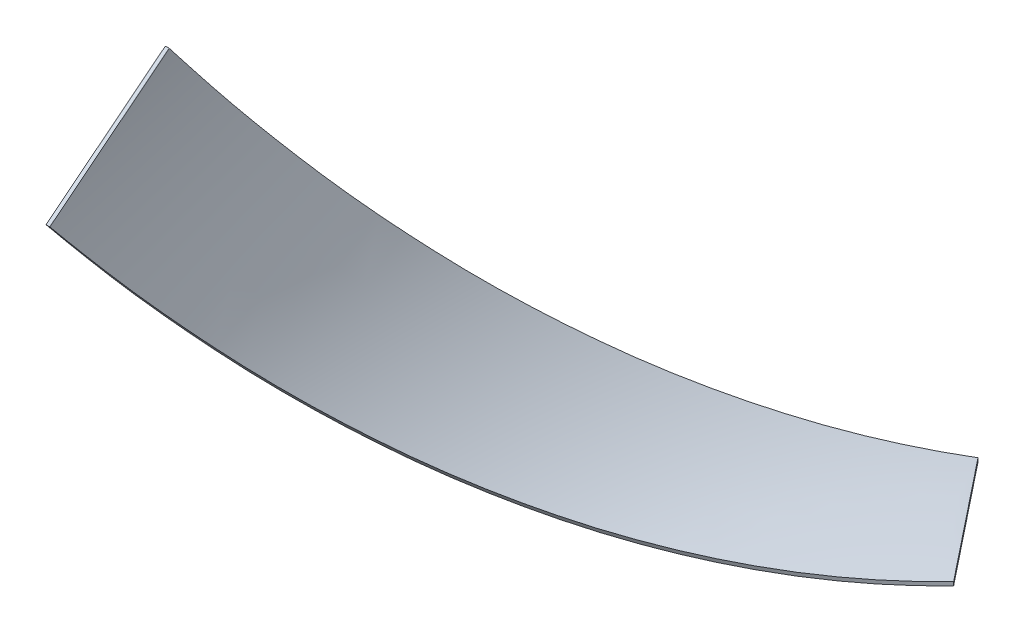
ISO-10303-21;
HEADER;
FILE_DESCRIPTION(('STEP AP214'),'2;1');
FILE_NAME('part.step','',(''),(''),'','','');
FILE_SCHEMA(('AUTOMOTIVE_DESIGN { 1 0 10303 214 1 1 1 1 }'));
ENDSEC;
DATA;
#1=APPLICATION_CONTEXT('core data for automotive mechanical design processes');
#2=APPLICATION_PROTOCOL_DEFINITION('international standard','automotive_design',2000,#1);
#3=PRODUCT_CONTEXT('',#1,'mechanical');
#4=PRODUCT('Part','Part','',(#3));
#5=PRODUCT_RELATED_PRODUCT_CATEGORY('part','',(#4));
#6=PRODUCT_DEFINITION_FORMATION('','',#4);
#7=PRODUCT_DEFINITION_CONTEXT('part definition',#1,'design');
#8=PRODUCT_DEFINITION('design','',#6,#7);
#9=PRODUCT_DEFINITION_SHAPE('','',#8);
#10=(LENGTH_UNIT() NAMED_UNIT(*) SI_UNIT(.MILLI.,.METRE.));
#11=(NAMED_UNIT(*) PLANE_ANGLE_UNIT() SI_UNIT($,.RADIAN.));
#12=(NAMED_UNIT(*) SI_UNIT($,.STERADIAN.) SOLID_ANGLE_UNIT());
#13=UNCERTAINTY_MEASURE_WITH_UNIT(LENGTH_MEASURE(1.E-05),#10,'distance_accuracy_value','');
#14=(GEOMETRIC_REPRESENTATION_CONTEXT(3) GLOBAL_UNCERTAINTY_ASSIGNED_CONTEXT((#13)) GLOBAL_UNIT_ASSIGNED_CONTEXT((#10,
#11,#12)) REPRESENTATION_CONTEXT('',''));
#15=CARTESIAN_POINT('',(0.,0.,0.));
#16=DIRECTION('',(0.,0.,1.));
#17=DIRECTION('',(1.,0.,0.));
#18=AXIS2_PLACEMENT_3D('',#15,#16,#17);
#19=CARTESIAN_POINT('',(-6.22676992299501,-49.75,-7.82478985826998));
#20=DIRECTION('',(-0.782478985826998,0.,0.622676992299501));
#21=DIRECTION('',(0.622676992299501,0.,0.782478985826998));
#22=AXIS2_PLACEMENT_3D('',#19,#20,#21);
#23=PLANE('',#22);
#24=DIRECTION('',(0.,1.,0.));
#25=VECTOR('',#24,1.);
#26=CARTESIAN_POINT('',(-6.22676992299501,-49.75,-7.82478985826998));
#27=LINE('',#26,#25);
#28=CARTESIAN_POINT('',(-6.22676992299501,-50.25,-7.82478985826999));
#29=VERTEX_POINT('',#28);
#30=CARTESIAN_POINT('',(-6.22676992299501,-49.75,-7.82478985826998));
#31=VERTEX_POINT('',#30);
#32=EDGE_CURVE('E73',#29,#31,#27,.T.);
#33=ORIENTED_EDGE('',*,*,#32,.T.);
#34=DIRECTION('',(0.622676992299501,0.,0.782478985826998));
#35=VECTOR('',#34,1.);
#36=CARTESIAN_POINT('',(-6.22676992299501,-49.75,-7.82478985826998));
#37=LINE('',#36,#35);
#38=CARTESIAN_POINT('',(6.22676992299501,-49.75,7.82478985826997));
#39=VERTEX_POINT('',#38);
#40=EDGE_CURVE('E68',#31,#39,#37,.T.);
#41=ORIENTED_EDGE('',*,*,#40,.T.);
#42=DIRECTION('',(0.,-1.,0.));
#43=VECTOR('',#42,1.);
#44=CARTESIAN_POINT('',(6.22676992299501,-49.75,7.82478985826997));
#45=LINE('',#44,#43);
#46=CARTESIAN_POINT('',(6.22676992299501,-50.25,7.82478985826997));
#47=VERTEX_POINT('',#46);
#48=EDGE_CURVE('E85',#39,#47,#45,.T.);
#49=ORIENTED_EDGE('',*,*,#48,.T.);
#50=DIRECTION('',(-0.622676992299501,0.,-0.782478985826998));
#51=VECTOR('',#50,1.);
#52=CARTESIAN_POINT('',(-6.22676992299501,-50.25,-7.82478985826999));
#53=LINE('',#52,#51);
#54=EDGE_CURVE('E78',#47,#29,#53,.T.);
#55=ORIENTED_EDGE('',*,*,#54,.T.);
#56=EDGE_LOOP('',(#33,#41,#49,#55));
#57=FACE_BOUND('',#56,.T.);
#58=ADVANCED_FACE('F33',(#57),#23,.F.);
#59=CARTESIAN_POINT('',(-49.75,6.22676992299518,54.67521014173));
#60=DIRECTION('',(0.,0.782478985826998,0.622676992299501));
#61=DIRECTION('',(0.,-0.622676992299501,0.782478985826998));
#62=AXIS2_PLACEMENT_3D('',#59,#60,#61);
#63=PLANE('',#62);
#64=DIRECTION('',(1.,0.,0.));
#65=VECTOR('',#64,1.);
#66=CARTESIAN_POINT('',(-49.75,6.22676992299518,54.67521014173));
#67=LINE('',#66,#65);
#68=CARTESIAN_POINT('',(-50.25,6.22676992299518,54.67521014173));
#69=VERTEX_POINT('',#68);
#70=CARTESIAN_POINT('',(-49.75,6.22676992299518,54.67521014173));
#71=VERTEX_POINT('',#70);
#72=EDGE_CURVE('E47',#69,#71,#67,.T.);
#73=ORIENTED_EDGE('',*,*,#72,.F.);
#74=DIRECTION('',(0.,0.622676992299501,-0.782478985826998));
#75=VECTOR('',#74,1.);
#76=CARTESIAN_POINT('',(-50.25,6.22676992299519,54.67521014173));
#77=LINE('',#76,#75);
#78=CARTESIAN_POINT('',(-50.25,-6.22676992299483,70.32478985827));
#79=VERTEX_POINT('',#78);
#80=EDGE_CURVE('E56',#79,#69,#77,.T.);
#81=ORIENTED_EDGE('',*,*,#80,.F.);
#82=DIRECTION('',(-1.,0.,0.));
#83=VECTOR('',#82,1.);
#84=CARTESIAN_POINT('',(-49.75,-6.22676992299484,70.32478985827));
#85=LINE('',#84,#83);
#86=CARTESIAN_POINT('',(-49.75,-6.22676992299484,70.32478985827));
#87=VERTEX_POINT('',#86);
#88=EDGE_CURVE('E93',#87,#79,#85,.T.);
#89=ORIENTED_EDGE('',*,*,#88,.F.);
#90=DIRECTION('',(0.,-0.622676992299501,0.782478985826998));
#91=VECTOR('',#90,1.);
#92=CARTESIAN_POINT('',(-49.75,6.22676992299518,54.67521014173));
#93=LINE('',#92,#91);
#94=EDGE_CURVE('E11',#71,#87,#93,.T.);
#95=ORIENTED_EDGE('',*,*,#94,.F.);
#96=EDGE_LOOP('',(#73,#81,#89,#95));
#97=FACE_BOUND('',#96,.T.);
#98=ADVANCED_FACE('F147',(#97),#63,.T.);
#99=CARTESIAN_POINT('',(6.22676992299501,-49.75,7.82478985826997));
#100=CARTESIAN_POINT('',(-0.926200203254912,-50.6452743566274,13.5066080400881));
#101=CARTESIAN_POINT('',(-8.04165271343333,-49.4890592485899,19.1884262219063));
#102=CARTESIAN_POINT('',(-15.1571052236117,-48.3328441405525,24.8702444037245));
#103=CARTESIAN_POINT('',(-21.6585884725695,-45.2188092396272,30.5520625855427));
#104=CARTESIAN_POINT('',(-28.1600717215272,-42.104774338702,36.2338807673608));
#105=CARTESIAN_POINT('',(-33.5208742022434,-37.2852002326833,41.915698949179));
#106=CARTESIAN_POINT('',(-38.8816766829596,-32.4656261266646,47.5975171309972));
#107=CARTESIAN_POINT('',(-42.6674980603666,-26.3309660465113,53.2793353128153));
#108=CARTESIAN_POINT('',(-46.4533194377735,-20.196305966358,58.9611534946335));
#109=CARTESIAN_POINT('',(-48.3574549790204,-13.2435535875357,64.6429716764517));
#110=CARTESIAN_POINT('',(-50.2615905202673,-6.2908012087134,70.3247898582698));
#111=CARTESIAN_POINT('',(-50.1297784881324,0.916772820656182,76.006608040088));
#112=CARTESIAN_POINT('',(6.22676992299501,-50.25,7.82478985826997));
#113=CARTESIAN_POINT('',(-0.998089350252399,-51.1452743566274,13.5066080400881));
#114=CARTESIAN_POINT('',(-8.18251899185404,-49.9688057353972,19.1884262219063));
#115=CARTESIAN_POINT('',(-15.3669486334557,-48.792337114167,24.8702444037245));
#116=CARTESIAN_POINT('',(-21.9289088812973,-45.6394360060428,30.5520625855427));
#117=CARTESIAN_POINT('',(-28.4908691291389,-42.4865348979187,36.2338807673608));
#118=CARTESIAN_POINT('',(-33.8987489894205,-37.612630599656,41.915698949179));
#119=CARTESIAN_POINT('',(-39.3066288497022,-32.7387263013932,47.5975171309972));
#120=CARTESIAN_POINT('',(-43.1223140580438,-26.5386735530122,53.2793353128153));
#121=CARTESIAN_POINT('',(-46.9379992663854,-20.3386208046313,58.9611534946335));
#122=CARTESIAN_POINT('',(-48.8523656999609,-13.3147110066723,64.6429716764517));
#123=CARTESIAN_POINT('',(-50.7667321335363,-6.2908012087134,70.3247898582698));
#124=CARTESIAN_POINT('',(-50.6246892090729,0.987930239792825,76.006608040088));
#125=(BOUNDED_SURFACE() B_SPLINE_SURFACE(1,2,((#99,#100,#101,#102,#103,#104,#105,#106,#107,#108,
#109,#110,#111),(#112,#113,#114,#115,#116,#117,#118,#119,#120,#121,#122,#123,#124)),
.UNSPECIFIED.,.F.,.F.,.F.) B_SPLINE_SURFACE_WITH_KNOTS((2,2),(3,2,2,2,2,2,3),(0.,1.),(0.,
0.166666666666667,0.333333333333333,0.5,0.666666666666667,0.833333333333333,1.),
.UNSPECIFIED.) GEOMETRIC_REPRESENTATION_ITEM() RATIONAL_B_SPLINE_SURFACE(((1.,0.989821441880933,
1.,0.989821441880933,1.,0.989821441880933,1.,0.989821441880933,1.,0.989821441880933,1.,
0.989821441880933,1.),(1.,0.989821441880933,1.,0.989821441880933,1.,0.989821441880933,1.,
0.989821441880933,1.,0.989821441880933,1.,0.989821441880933,1.))) REPRESENTATION_ITEM('') SURFACE());
#126=CARTESIAN_POINT('',(6.22676992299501,-50.25,7.82478985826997));
#127=CARTESIAN_POINT('',(-0.998089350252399,-51.1452743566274,13.5066080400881));
#128=CARTESIAN_POINT('',(-8.18251899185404,-49.9688057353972,19.1884262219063));
#129=CARTESIAN_POINT('',(-15.3669486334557,-48.792337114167,24.8702444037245));
#130=CARTESIAN_POINT('',(-21.9289088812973,-45.6394360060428,30.5520625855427));
#131=CARTESIAN_POINT('',(-28.4908691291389,-42.4865348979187,36.2338807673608));
#132=CARTESIAN_POINT('',(-33.8987489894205,-37.612630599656,41.915698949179));
#133=CARTESIAN_POINT('',(-39.3066288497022,-32.7387263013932,47.5975171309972));
#134=CARTESIAN_POINT('',(-43.1223140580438,-26.5386735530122,53.2793353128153));
#135=CARTESIAN_POINT('',(-46.9379992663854,-20.3386208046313,58.9611534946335));
#136=CARTESIAN_POINT('',(-48.8523656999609,-13.3147110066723,64.6429716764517));
#137=CARTESIAN_POINT('',(-50.7667321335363,-6.2908012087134,70.3247898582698));
#138=CARTESIAN_POINT('',(-50.6246892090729,0.987930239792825,76.006608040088));
#139=(BOUNDED_CURVE() B_SPLINE_CURVE(2,(#126,#127,#128,#129,#130,#131,#132,#133,#134,#135,#136,
#137,#138),.UNSPECIFIED.,.F.,.F.) B_SPLINE_CURVE_WITH_KNOTS((3,2,2,2,2,2,3),(0.,
0.166666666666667,0.333333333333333,0.5,0.666666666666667,0.833333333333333,1.),
.UNSPECIFIED.) CURVE() GEOMETRIC_REPRESENTATION_ITEM() RATIONAL_B_SPLINE_CURVE((1.,
0.989821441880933,1.,0.989821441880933,1.,0.989821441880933,1.,0.989821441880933,1.,
0.989821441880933,1.,0.989821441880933,1.)) REPRESENTATION_ITEM(''));
#140=EDGE_CURVE('E88',#47,#79,#139,.T.);
#141=CARTESIAN_POINT('',(6.22676992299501,-49.75,7.82478985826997));
#142=CARTESIAN_POINT('',(-0.926200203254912,-50.6452743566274,13.5066080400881));
#143=CARTESIAN_POINT('',(-8.04165271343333,-49.4890592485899,19.1884262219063));
#144=CARTESIAN_POINT('',(-15.1571052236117,-48.3328441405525,24.8702444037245));
#145=CARTESIAN_POINT('',(-21.6585884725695,-45.2188092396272,30.5520625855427));
#146=CARTESIAN_POINT('',(-28.1600717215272,-42.104774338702,36.2338807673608));
#147=CARTESIAN_POINT('',(-33.5208742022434,-37.2852002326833,41.915698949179));
#148=CARTESIAN_POINT('',(-38.8816766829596,-32.4656261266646,47.5975171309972));
#149=CARTESIAN_POINT('',(-42.6674980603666,-26.3309660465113,53.2793353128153));
#150=CARTESIAN_POINT('',(-46.4533194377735,-20.196305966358,58.9611534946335));
#151=CARTESIAN_POINT('',(-48.3574549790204,-13.2435535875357,64.6429716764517));
#152=CARTESIAN_POINT('',(-50.2615905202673,-6.2908012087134,70.3247898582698));
#153=CARTESIAN_POINT('',(-50.1297784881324,0.916772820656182,76.006608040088));
#154=(BOUNDED_CURVE() B_SPLINE_CURVE(2,(#141,#142,#143,#144,#145,#146,#147,#148,#149,#150,#151,
#152,#153),.UNSPECIFIED.,.F.,.F.) B_SPLINE_CURVE_WITH_KNOTS((3,2,2,2,2,2,3),(0.,
0.166666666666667,0.333333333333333,0.5,0.666666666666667,0.833333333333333,1.),
.UNSPECIFIED.) CURVE() GEOMETRIC_REPRESENTATION_ITEM() RATIONAL_B_SPLINE_CURVE((1.,
0.989821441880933,1.,0.989821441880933,1.,0.989821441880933,1.,0.989821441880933,1.,
0.989821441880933,1.,0.989821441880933,1.)) REPRESENTATION_ITEM(''));
#155=EDGE_CURVE('E87',#39,#87,#154,.T.);
#156=ORIENTED_EDGE('',*,*,#140,.F.);
#157=ORIENTED_EDGE('',*,*,#48,.F.);
#158=ORIENTED_EDGE('',*,*,#155,.T.);
#159=ORIENTED_EDGE('',*,*,#88,.T.);
#160=EDGE_LOOP('',(#156,#157,#158,#159));
#161=FACE_BOUND('',#160,.T.);
#162=ADVANCED_FACE('F86',(#161),#125,.F.);
#163=CARTESIAN_POINT('',(6.22676992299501,-50.25,7.82478985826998));
#164=CARTESIAN_POINT('',(-0.998089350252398,-51.1452743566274,13.5066080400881));
#165=CARTESIAN_POINT('',(-8.18251899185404,-49.9688057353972,19.1884262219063));
#166=CARTESIAN_POINT('',(-15.3669486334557,-48.792337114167,24.8702444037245));
#167=CARTESIAN_POINT('',(-21.9289088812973,-45.6394360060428,30.5520625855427));
#168=CARTESIAN_POINT('',(-28.4908691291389,-42.4865348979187,36.2338807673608));
#169=CARTESIAN_POINT('',(-33.8987489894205,-37.612630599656,41.915698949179));
#170=CARTESIAN_POINT('',(-39.3066288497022,-32.7387263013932,47.5975171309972));
#171=CARTESIAN_POINT('',(-43.1223140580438,-26.5386735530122,53.2793353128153));
#172=CARTESIAN_POINT('',(-46.9379992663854,-20.3386208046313,58.9611534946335));
#173=CARTESIAN_POINT('',(-48.8523656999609,-13.3147110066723,64.6429716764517));
#174=CARTESIAN_POINT('',(-50.7667321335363,-6.2908012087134,70.3247898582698));
#175=CARTESIAN_POINT('',(-50.6246892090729,0.987930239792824,76.006608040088));
#176=CARTESIAN_POINT('',(-6.22676992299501,-50.25,-7.82478985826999));
#177=CARTESIAN_POINT('',(-13.4516291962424,-49.3547256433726,-2.14297167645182));
#178=CARTESIAN_POINT('',(-20.1316029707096,-46.4602381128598,3.53884650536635));
#179=CARTESIAN_POINT('',(-26.8115767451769,-43.565750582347,9.22066468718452));
#180=CARTESIAN_POINT('',(-32.4054932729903,-38.9065440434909,14.9024828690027));
#181=CARTESIAN_POINT('',(-37.9994098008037,-34.2473375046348,20.5843010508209));
#182=CARTESIAN_POINT('',(-42.0540832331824,-28.2008731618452,26.266119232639));
#183=CARTESIAN_POINT('',(-46.1087566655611,-22.1544088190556,31.9479374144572));
#184=CARTESIAN_POINT('',(-48.2957014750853,-15.2105352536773,37.6297555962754));
#185=CARTESIAN_POINT('',(-50.4826462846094,-8.26666168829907,43.3115737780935));
#186=CARTESIAN_POINT('',(-50.6246892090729,-0.987930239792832,48.9933919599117));
#187=CARTESIAN_POINT('',(-50.7667321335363,6.29080120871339,54.6752101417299));
#188=CARTESIAN_POINT('',(-48.8523656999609,13.3147110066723,60.357028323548));
#189=(BOUNDED_SURFACE() B_SPLINE_SURFACE(1,2,((#163,#164,#165,#166,#167,#168,#169,#170,#171,
#172,#173,#174,#175),(#176,#177,#178,#179,#180,#181,#182,#183,#184,#185,#186,#187,#188)),
.UNSPECIFIED.,.F.,.F.,.F.) B_SPLINE_SURFACE_WITH_KNOTS((2,2),(3,2,2,2,2,2,3),(0.,1.),(0.,
0.166666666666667,0.333333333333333,0.5,0.666666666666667,0.833333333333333,1.),
.UNSPECIFIED.) GEOMETRIC_REPRESENTATION_ITEM() RATIONAL_B_SPLINE_SURFACE(((1.,0.989821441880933,
1.,0.989821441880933,1.,0.989821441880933,1.,0.989821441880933,1.,0.989821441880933,1.,
0.989821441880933,1.),(1.,0.989821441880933,1.,0.989821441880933,1.,0.989821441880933,1.,
0.989821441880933,1.,0.989821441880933,1.,0.989821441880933,1.))) REPRESENTATION_ITEM('') SURFACE());
#190=CARTESIAN_POINT('',(-6.22676992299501,-50.25,-7.82478985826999));
#191=CARTESIAN_POINT('',(-13.4516291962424,-49.3547256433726,-2.14297167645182));
#192=CARTESIAN_POINT('',(-20.1316029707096,-46.4602381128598,3.53884650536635));
#193=CARTESIAN_POINT('',(-26.8115767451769,-43.565750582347,9.22066468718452));
#194=CARTESIAN_POINT('',(-32.4054932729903,-38.9065440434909,14.9024828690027));
#195=CARTESIAN_POINT('',(-37.9994098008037,-34.2473375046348,20.5843010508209));
#196=CARTESIAN_POINT('',(-42.0540832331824,-28.2008731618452,26.266119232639));
#197=CARTESIAN_POINT('',(-46.1087566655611,-22.1544088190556,31.9479374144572));
#198=CARTESIAN_POINT('',(-48.2957014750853,-15.2105352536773,37.6297555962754));
#199=CARTESIAN_POINT('',(-50.4826462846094,-8.26666168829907,43.3115737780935));
#200=CARTESIAN_POINT('',(-50.6246892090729,-0.987930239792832,48.9933919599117));
#201=CARTESIAN_POINT('',(-50.7667321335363,6.29080120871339,54.6752101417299));
#202=CARTESIAN_POINT('',(-48.8523656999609,13.3147110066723,60.357028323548));
#203=(BOUNDED_CURVE() B_SPLINE_CURVE(2,(#190,#191,#192,#193,#194,#195,#196,#197,#198,#199,#200,
#201,#202),.UNSPECIFIED.,.F.,.F.) B_SPLINE_CURVE_WITH_KNOTS((3,2,2,2,2,2,3),(0.,
0.166666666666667,0.333333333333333,0.5,0.666666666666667,0.833333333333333,1.),
.UNSPECIFIED.) CURVE() GEOMETRIC_REPRESENTATION_ITEM() RATIONAL_B_SPLINE_CURVE((1.,
0.989821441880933,1.,0.989821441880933,1.,0.989821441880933,1.,0.989821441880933,1.,
0.989821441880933,1.,0.989821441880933,1.)) REPRESENTATION_ITEM(''));
#204=EDGE_CURVE('E108',#29,#69,#203,.T.);
#205=ORIENTED_EDGE('',*,*,#204,.F.);
#206=ORIENTED_EDGE('',*,*,#54,.F.);
#207=ORIENTED_EDGE('',*,*,#140,.T.);
#208=ORIENTED_EDGE('',*,*,#80,.T.);
#209=EDGE_LOOP('',(#205,#206,#207,#208));
#210=FACE_BOUND('',#209,.T.);
#211=ADVANCED_FACE('F126',(#210),#189,.F.);
#212=CARTESIAN_POINT('',(-6.22676992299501,-50.25,-7.82478985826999));
#213=CARTESIAN_POINT('',(-13.4516291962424,-49.3547256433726,-2.14297167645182));
#214=CARTESIAN_POINT('',(-20.1316029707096,-46.4602381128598,3.53884650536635));
#215=CARTESIAN_POINT('',(-26.8115767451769,-43.565750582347,9.22066468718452));
#216=CARTESIAN_POINT('',(-32.4054932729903,-38.9065440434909,14.9024828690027));
#217=CARTESIAN_POINT('',(-37.9994098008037,-34.2473375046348,20.5843010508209));
#218=CARTESIAN_POINT('',(-42.0540832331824,-28.2008731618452,26.266119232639));
#219=CARTESIAN_POINT('',(-46.1087566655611,-22.1544088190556,31.9479374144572));
#220=CARTESIAN_POINT('',(-48.2957014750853,-15.2105352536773,37.6297555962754));
#221=CARTESIAN_POINT('',(-50.4826462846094,-8.26666168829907,43.3115737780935));
#222=CARTESIAN_POINT('',(-50.6246892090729,-0.987930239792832,48.9933919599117));
#223=CARTESIAN_POINT('',(-50.7667321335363,6.29080120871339,54.6752101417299));
#224=CARTESIAN_POINT('',(-48.8523656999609,13.3147110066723,60.357028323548));
#225=CARTESIAN_POINT('',(-6.22676992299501,-49.75,-7.82478985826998));
#226=CARTESIAN_POINT('',(-13.3797400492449,-48.8547256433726,-2.14297167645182));
#227=CARTESIAN_POINT('',(-19.9907366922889,-45.9804916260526,3.53884650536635));
#228=CARTESIAN_POINT('',(-26.6017333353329,-43.1062576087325,9.22066468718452));
#229=CARTESIAN_POINT('',(-32.1351728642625,-38.4859172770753,14.9024828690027));
#230=CARTESIAN_POINT('',(-37.668612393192,-33.8655769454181,20.5843010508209));
#231=CARTESIAN_POINT('',(-41.6762084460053,-27.8734427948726,26.266119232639));
#232=CARTESIAN_POINT('',(-45.6838044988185,-21.881308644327,31.9479374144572));
#233=CARTESIAN_POINT('',(-47.840885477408,-15.0028277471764,37.6297555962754));
#234=CARTESIAN_POINT('',(-49.9979664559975,-8.12434685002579,43.3115737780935));
#235=CARTESIAN_POINT('',(-50.1297784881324,-0.91677282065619,48.9933919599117));
#236=CARTESIAN_POINT('',(-50.2615905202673,6.29080120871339,54.6752101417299));
#237=CARTESIAN_POINT('',(-48.3574549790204,13.2435535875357,60.357028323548));
#238=(BOUNDED_SURFACE() B_SPLINE_SURFACE(1,2,((#212,#213,#214,#215,#216,#217,#218,#219,#220,
#221,#222,#223,#224),(#225,#226,#227,#228,#229,#230,#231,#232,#233,#234,#235,#236,#237)),
.UNSPECIFIED.,.F.,.F.,.F.) B_SPLINE_SURFACE_WITH_KNOTS((2,2),(3,2,2,2,2,2,3),(0.,1.),(0.,
0.166666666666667,0.333333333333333,0.5,0.666666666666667,0.833333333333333,1.),
.UNSPECIFIED.) GEOMETRIC_REPRESENTATION_ITEM() RATIONAL_B_SPLINE_SURFACE(((1.,0.989821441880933,
1.,0.989821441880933,1.,0.989821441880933,1.,0.989821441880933,1.,0.989821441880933,1.,
0.989821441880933,1.),(1.,0.989821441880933,1.,0.989821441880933,1.,0.989821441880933,1.,
0.989821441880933,1.,0.989821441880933,1.,0.989821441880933,1.))) REPRESENTATION_ITEM('') SURFACE());
#239=CARTESIAN_POINT('',(-6.22676992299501,-49.75,-7.82478985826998));
#240=CARTESIAN_POINT('',(-13.3797400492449,-48.8547256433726,-2.14297167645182));
#241=CARTESIAN_POINT('',(-19.9907366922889,-45.9804916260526,3.53884650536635));
#242=CARTESIAN_POINT('',(-26.6017333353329,-43.1062576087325,9.22066468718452));
#243=CARTESIAN_POINT('',(-32.1351728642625,-38.4859172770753,14.9024828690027));
#244=CARTESIAN_POINT('',(-37.668612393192,-33.8655769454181,20.5843010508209));
#245=CARTESIAN_POINT('',(-41.6762084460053,-27.8734427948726,26.266119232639));
#246=CARTESIAN_POINT('',(-45.6838044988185,-21.881308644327,31.9479374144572));
#247=CARTESIAN_POINT('',(-47.840885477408,-15.0028277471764,37.6297555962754));
#248=CARTESIAN_POINT('',(-49.9979664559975,-8.12434685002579,43.3115737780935));
#249=CARTESIAN_POINT('',(-50.1297784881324,-0.91677282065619,48.9933919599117));
#250=CARTESIAN_POINT('',(-50.2615905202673,6.29080120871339,54.6752101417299));
#251=CARTESIAN_POINT('',(-48.3574549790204,13.2435535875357,60.357028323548));
#252=(BOUNDED_CURVE() B_SPLINE_CURVE(2,(#239,#240,#241,#242,#243,#244,#245,#246,#247,#248,#249,
#250,#251),.UNSPECIFIED.,.F.,.F.) B_SPLINE_CURVE_WITH_KNOTS((3,2,2,2,2,2,3),(0.,
0.166666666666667,0.333333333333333,0.5,0.666666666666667,0.833333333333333,1.),
.UNSPECIFIED.) CURVE() GEOMETRIC_REPRESENTATION_ITEM() RATIONAL_B_SPLINE_CURVE((1.,
0.989821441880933,1.,0.989821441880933,1.,0.989821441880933,1.,0.989821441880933,1.,
0.989821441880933,1.,0.989821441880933,1.)) REPRESENTATION_ITEM(''));
#253=EDGE_CURVE('E40',#31,#71,#252,.T.);
#254=ORIENTED_EDGE('',*,*,#253,.F.);
#255=ORIENTED_EDGE('',*,*,#32,.F.);
#256=ORIENTED_EDGE('',*,*,#204,.T.);
#257=ORIENTED_EDGE('',*,*,#72,.T.);
#258=EDGE_LOOP('',(#254,#255,#256,#257));
#259=FACE_BOUND('',#258,.T.);
#260=ADVANCED_FACE('F124',(#259),#238,.F.);
#261=CARTESIAN_POINT('',(-6.22676992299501,-49.75,-7.82478985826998));
#262=CARTESIAN_POINT('',(-13.3797400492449,-48.8547256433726,-2.14297167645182));
#263=CARTESIAN_POINT('',(-19.9907366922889,-45.9804916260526,3.53884650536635));
#264=CARTESIAN_POINT('',(-26.6017333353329,-43.1062576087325,9.22066468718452));
#265=CARTESIAN_POINT('',(-32.1351728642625,-38.4859172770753,14.9024828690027));
#266=CARTESIAN_POINT('',(-37.668612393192,-33.8655769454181,20.5843010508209));
#267=CARTESIAN_POINT('',(-41.6762084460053,-27.8734427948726,26.266119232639));
#268=CARTESIAN_POINT('',(-45.6838044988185,-21.881308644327,31.9479374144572));
#269=CARTESIAN_POINT('',(-47.840885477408,-15.0028277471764,37.6297555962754));
#270=CARTESIAN_POINT('',(-49.9979664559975,-8.12434685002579,43.3115737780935));
#271=CARTESIAN_POINT('',(-50.1297784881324,-0.91677282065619,48.9933919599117));
#272=CARTESIAN_POINT('',(-50.2615905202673,6.29080120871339,54.6752101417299));
#273=CARTESIAN_POINT('',(-48.3574549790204,13.2435535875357,60.357028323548));
#274=CARTESIAN_POINT('',(6.22676992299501,-49.75,7.82478985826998));
#275=CARTESIAN_POINT('',(-0.926200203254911,-50.6452743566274,13.5066080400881));
#276=CARTESIAN_POINT('',(-8.04165271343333,-49.4890592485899,19.1884262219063));
#277=CARTESIAN_POINT('',(-15.1571052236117,-48.3328441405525,24.8702444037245));
#278=CARTESIAN_POINT('',(-21.6585884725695,-45.2188092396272,30.5520625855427));
#279=CARTESIAN_POINT('',(-28.1600717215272,-42.104774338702,36.2338807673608));
#280=CARTESIAN_POINT('',(-33.5208742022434,-37.2852002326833,41.915698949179));
#281=CARTESIAN_POINT('',(-38.8816766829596,-32.4656261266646,47.5975171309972));
#282=CARTESIAN_POINT('',(-42.6674980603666,-26.3309660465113,53.2793353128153));
#283=CARTESIAN_POINT('',(-46.4533194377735,-20.196305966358,58.9611534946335));
#284=CARTESIAN_POINT('',(-48.3574549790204,-13.2435535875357,64.6429716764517));
#285=CARTESIAN_POINT('',(-50.2615905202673,-6.2908012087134,70.3247898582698));
#286=CARTESIAN_POINT('',(-50.1297784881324,0.916772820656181,76.006608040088));
#287=(BOUNDED_SURFACE() B_SPLINE_SURFACE(1,2,((#261,#262,#263,#264,#265,#266,#267,#268,#269,
#270,#271,#272,#273),(#274,#275,#276,#277,#278,#279,#280,#281,#282,#283,#284,#285,#286)),
.UNSPECIFIED.,.F.,.F.,.F.) B_SPLINE_SURFACE_WITH_KNOTS((2,2),(3,2,2,2,2,2,3),(0.,1.),(0.,
0.166666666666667,0.333333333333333,0.5,0.666666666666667,0.833333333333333,1.),
.UNSPECIFIED.) GEOMETRIC_REPRESENTATION_ITEM() RATIONAL_B_SPLINE_SURFACE(((1.,0.989821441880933,
1.,0.989821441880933,1.,0.989821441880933,1.,0.989821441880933,1.,0.989821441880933,1.,
0.989821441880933,1.),(1.,0.989821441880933,1.,0.989821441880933,1.,0.989821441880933,1.,
0.989821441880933,1.,0.989821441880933,1.,0.989821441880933,1.))) REPRESENTATION_ITEM('') SURFACE());
#288=ORIENTED_EDGE('',*,*,#94,.T.);
#289=ORIENTED_EDGE('',*,*,#155,.F.);
#290=ORIENTED_EDGE('',*,*,#40,.F.);
#291=ORIENTED_EDGE('',*,*,#253,.T.);
#292=EDGE_LOOP('',(#288,#289,#290,#291));
#293=FACE_BOUND('',#292,.T.);
#294=ADVANCED_FACE('F91',(#293),#287,.F.);
#295=CLOSED_SHELL('',(#58,#98,#162,#211,#260,#294));
#296=MANIFOLD_SOLID_BREP('B2',#295);
#297=ADVANCED_BREP_SHAPE_REPRESENTATION('',(#18,#296),#14);
#298=SHAPE_DEFINITION_REPRESENTATION(#9,#297);
ENDSEC;
END-ISO-10303-21;
